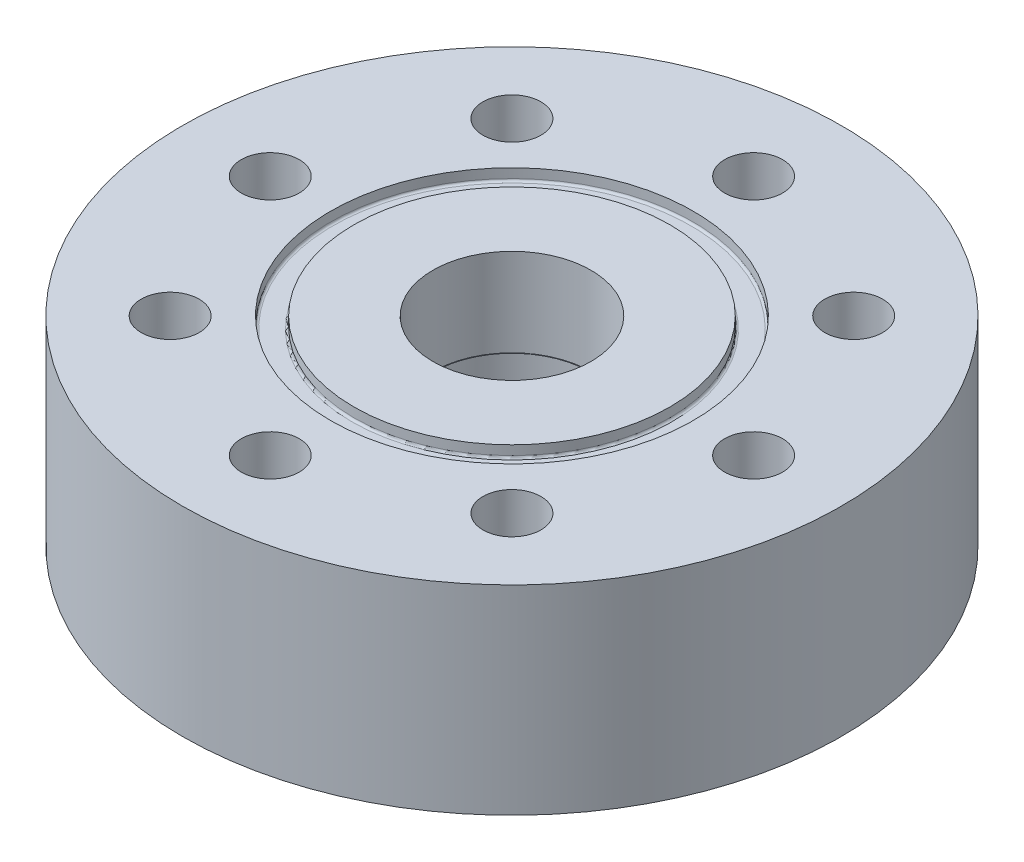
ISO-10303-21;
HEADER;
FILE_DESCRIPTION(('STEP AP214'),'2;1');
FILE_NAME('part.step','',(''),(''),'','','');
FILE_SCHEMA(('AUTOMOTIVE_DESIGN { 1 0 10303 214 1 1 1 1 }'));
ENDSEC;
DATA;
#1=APPLICATION_CONTEXT('core data for automotive mechanical design processes');
#2=APPLICATION_PROTOCOL_DEFINITION('international standard','automotive_design',2000,#1);
#3=PRODUCT_CONTEXT('',#1,'mechanical');
#4=PRODUCT('Part','Part','',(#3));
#5=PRODUCT_RELATED_PRODUCT_CATEGORY('part','',(#4));
#6=PRODUCT_DEFINITION_FORMATION('','',#4);
#7=PRODUCT_DEFINITION_CONTEXT('part definition',#1,'design');
#8=PRODUCT_DEFINITION('design','',#6,#7);
#9=PRODUCT_DEFINITION_SHAPE('','',#8);
#10=(LENGTH_UNIT() NAMED_UNIT(*) SI_UNIT(.MILLI.,.METRE.));
#11=(NAMED_UNIT(*) PLANE_ANGLE_UNIT() SI_UNIT($,.RADIAN.));
#12=(NAMED_UNIT(*) SI_UNIT($,.STERADIAN.) SOLID_ANGLE_UNIT());
#13=UNCERTAINTY_MEASURE_WITH_UNIT(LENGTH_MEASURE(1.E-05),#10,'distance_accuracy_value','');
#14=(GEOMETRIC_REPRESENTATION_CONTEXT(3) GLOBAL_UNCERTAINTY_ASSIGNED_CONTEXT((#13)) GLOBAL_UNIT_ASSIGNED_CONTEXT((#10,
#11,#12)) REPRESENTATION_CONTEXT('',''));
#15=CARTESIAN_POINT('',(0.,0.,0.));
#16=DIRECTION('',(0.,0.,1.));
#17=DIRECTION('',(1.,0.,0.));
#18=AXIS2_PLACEMENT_3D('',#15,#16,#17);
#19=CARTESIAN_POINT('',(0.,22.7,0.));
#20=DIRECTION('',(0.,-1.,0.));
#21=DIRECTION('',(0.,0.,-1.));
#22=AXIS2_PLACEMENT_3D('',#19,#20,#21);
#23=CYLINDRICAL_SURFACE('',#22,37.5);
#24=CARTESIAN_POINT('',(0.,22.7,0.));
#25=DIRECTION('',(0.,1.,0.));
#26=DIRECTION('',(0.,0.,1.));
#27=AXIS2_PLACEMENT_3D('',#24,#25,#26);
#28=CIRCLE('',#27,37.5);
#29=CARTESIAN_POINT('',(0.,22.7,37.5));
#30=VERTEX_POINT('',#29);
#31=EDGE_CURVE('E60',#30,#30,#28,.T.);
#32=ORIENTED_EDGE('',*,*,#31,.F.);
#33=EDGE_LOOP('',(#32));
#34=FACE_BOUND('',#33,.T.);
#35=CARTESIAN_POINT('',(0.,0.,0.));
#36=DIRECTION('',(0.,1.,0.));
#37=DIRECTION('',(0.,0.,1.));
#38=AXIS2_PLACEMENT_3D('',#35,#36,#37);
#39=CIRCLE('',#38,37.5);
#40=CARTESIAN_POINT('',(0.,0.,37.5));
#41=VERTEX_POINT('',#40);
#42=EDGE_CURVE('E61',#41,#41,#39,.T.);
#43=ORIENTED_EDGE('',*,*,#42,.T.);
#44=EDGE_LOOP('',(#43));
#45=FACE_BOUND('',#44,.T.);
#46=ADVANCED_FACE('F36',(#34,#45),#23,.T.);
#47=CARTESIAN_POINT('',(0.,22.7,0.));
#48=DIRECTION('',(0.,1.,0.));
#49=DIRECTION('',(0.,0.,1.));
#50=AXIS2_PLACEMENT_3D('',#47,#48,#49);
#51=PLANE('',#50);
#52=CARTESIAN_POINT('',(0.,22.7,0.));
#53=DIRECTION('',(0.,1.,0.));
#54=DIRECTION('',(0.,0.,1.));
#55=AXIS2_PLACEMENT_3D('',#52,#53,#54);
#56=CIRCLE('',#55,20.6375);
#57=CARTESIAN_POINT('',(0.,22.7,20.6375));
#58=VERTEX_POINT('',#57);
#59=EDGE_CURVE('E84',#58,#58,#56,.T.);
#60=ORIENTED_EDGE('',*,*,#59,.F.);
#61=EDGE_LOOP('',(#60));
#62=FACE_BOUND('',#61,.T.);
#63=CARTESIAN_POINT('',(-27.5,22.7,0.));
#64=DIRECTION('',(0.,-1.,0.));
#65=DIRECTION('',(0.,0.,-1.));
#66=AXIS2_PLACEMENT_3D('',#63,#64,#65);
#67=CIRCLE('',#66,3.3);
#68=CARTESIAN_POINT('',(-27.5,22.7,-3.3));
#69=VERTEX_POINT('',#68);
#70=EDGE_CURVE('E72',#69,#69,#67,.T.);
#71=ORIENTED_EDGE('',*,*,#70,.T.);
#72=EDGE_LOOP('',(#71));
#73=FACE_BOUND('',#72,.T.);
#74=CARTESIAN_POINT('',(-19.44543648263,22.7,19.4454364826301));
#75=DIRECTION('',(0.,-1.,0.));
#76=DIRECTION('',(0.,0.,-1.));
#77=AXIS2_PLACEMENT_3D('',#74,#75,#76);
#78=CIRCLE('',#77,3.30000000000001);
#79=CARTESIAN_POINT('',(-19.44543648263,22.7,16.1454364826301));
#80=VERTEX_POINT('',#79);
#81=EDGE_CURVE('E132',#80,#80,#78,.T.);
#82=ORIENTED_EDGE('',*,*,#81,.T.);
#83=EDGE_LOOP('',(#82));
#84=FACE_BOUND('',#83,.T.);
#85=CARTESIAN_POINT('',(0.,22.7,27.5));
#86=DIRECTION('',(0.,-1.,0.));
#87=DIRECTION('',(0.,0.,-1.));
#88=AXIS2_PLACEMENT_3D('',#85,#86,#87);
#89=CIRCLE('',#88,3.3);
#90=CARTESIAN_POINT('',(0.,22.7,24.2));
#91=VERTEX_POINT('',#90);
#92=EDGE_CURVE('E124',#91,#91,#89,.T.);
#93=ORIENTED_EDGE('',*,*,#92,.T.);
#94=EDGE_LOOP('',(#93));
#95=FACE_BOUND('',#94,.T.);
#96=CARTESIAN_POINT('',(19.4454364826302,22.7,19.44543648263));
#97=DIRECTION('',(0.,-1.,0.));
#98=DIRECTION('',(0.,0.,-1.));
#99=AXIS2_PLACEMENT_3D('',#96,#97,#98);
#100=CIRCLE('',#99,3.3);
#101=CARTESIAN_POINT('',(19.4454364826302,22.7,16.14543648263));
#102=VERTEX_POINT('',#101);
#103=EDGE_CURVE('E116',#102,#102,#100,.T.);
#104=ORIENTED_EDGE('',*,*,#103,.T.);
#105=EDGE_LOOP('',(#104));
#106=FACE_BOUND('',#105,.T.);
#107=CARTESIAN_POINT('',(27.5,22.7,-1.92031473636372E-13));
#108=DIRECTION('',(0.,-1.,0.));
#109=DIRECTION('',(0.,0.,-1.));
#110=AXIS2_PLACEMENT_3D('',#107,#108,#109);
#111=CIRCLE('',#110,3.3);
#112=CARTESIAN_POINT('',(27.5,22.7,-3.30000000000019));
#113=VERTEX_POINT('',#112);
#114=EDGE_CURVE('E108',#113,#113,#111,.T.);
#115=ORIENTED_EDGE('',*,*,#114,.T.);
#116=EDGE_LOOP('',(#115));
#117=FACE_BOUND('',#116,.T.);
#118=CARTESIAN_POINT('',(19.4454364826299,22.7,-19.4454364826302));
#119=DIRECTION('',(0.,-1.,0.));
#120=DIRECTION('',(0.,0.,-1.));
#121=AXIS2_PLACEMENT_3D('',#118,#119,#120);
#122=CIRCLE('',#121,3.3);
#123=CARTESIAN_POINT('',(19.4454364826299,22.7,-22.7454364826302));
#124=VERTEX_POINT('',#123);
#125=EDGE_CURVE('E100',#124,#124,#122,.T.);
#126=ORIENTED_EDGE('',*,*,#125,.T.);
#127=EDGE_LOOP('',(#126));
#128=FACE_BOUND('',#127,.T.);
#129=CARTESIAN_POINT('',(-2.88047210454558E-13,22.7,-27.5));
#130=DIRECTION('',(0.,-1.,0.));
#131=DIRECTION('',(0.,0.,-1.));
#132=AXIS2_PLACEMENT_3D('',#129,#130,#131);
#133=CIRCLE('',#132,3.3);
#134=CARTESIAN_POINT('',(-2.88047210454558E-13,22.7,-30.8));
#135=VERTEX_POINT('',#134);
#136=EDGE_CURVE('E92',#135,#135,#133,.T.);
#137=ORIENTED_EDGE('',*,*,#136,.T.);
#138=EDGE_LOOP('',(#137));
#139=FACE_BOUND('',#138,.T.);
#140=CARTESIAN_POINT('',(-19.4454364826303,22.7,-19.4454364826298));
#141=DIRECTION('',(0.,-1.,0.));
#142=DIRECTION('',(0.,0.,-1.));
#143=AXIS2_PLACEMENT_3D('',#140,#141,#142);
#144=CIRCLE('',#143,3.3);
#145=CARTESIAN_POINT('',(-19.4454364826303,22.7,-22.7454364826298));
#146=VERTEX_POINT('',#145);
#147=EDGE_CURVE('E83',#146,#146,#144,.T.);
#148=ORIENTED_EDGE('',*,*,#147,.T.);
#149=EDGE_LOOP('',(#148));
#150=FACE_BOUND('',#149,.T.);
#151=ORIENTED_EDGE('',*,*,#31,.T.);
#152=EDGE_LOOP('',(#151));
#153=FACE_BOUND('',#152,.T.);
#154=ADVANCED_FACE('F172',(#62,#73,#84,#95,#106,#117,#128,#139,#150,#153),#51,.T.);
#155=CARTESIAN_POINT('',(0.,0.,0.));
#156=DIRECTION('',(0.,1.,0.));
#157=DIRECTION('',(0.,0.,1.));
#158=AXIS2_PLACEMENT_3D('',#155,#156,#157);
#159=PLANE('',#158);
#160=CARTESIAN_POINT('',(-27.5,0.,0.));
#161=DIRECTION('',(0.,-1.,0.));
#162=DIRECTION('',(0.,0.,-1.));
#163=AXIS2_PLACEMENT_3D('',#160,#161,#162);
#164=CIRCLE('',#163,3.3);
#165=CARTESIAN_POINT('',(-27.5,0.,-3.3));
#166=VERTEX_POINT('',#165);
#167=EDGE_CURVE('E136',#166,#166,#164,.T.);
#168=ORIENTED_EDGE('',*,*,#167,.F.);
#169=EDGE_LOOP('',(#168));
#170=FACE_BOUND('',#169,.T.);
#171=CARTESIAN_POINT('',(-19.44543648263,0.,19.4454364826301));
#172=DIRECTION('',(0.,-1.,0.));
#173=DIRECTION('',(0.,0.,-1.));
#174=AXIS2_PLACEMENT_3D('',#171,#172,#173);
#175=CIRCLE('',#174,3.30000000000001);
#176=CARTESIAN_POINT('',(-19.44543648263,0.,16.1454364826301));
#177=VERTEX_POINT('',#176);
#178=EDGE_CURVE('E128',#177,#177,#175,.T.);
#179=ORIENTED_EDGE('',*,*,#178,.F.);
#180=EDGE_LOOP('',(#179));
#181=FACE_BOUND('',#180,.T.);
#182=CARTESIAN_POINT('',(0.,0.,27.5));
#183=DIRECTION('',(0.,-1.,0.));
#184=DIRECTION('',(0.,0.,-1.));
#185=AXIS2_PLACEMENT_3D('',#182,#183,#184);
#186=CIRCLE('',#185,3.3);
#187=CARTESIAN_POINT('',(0.,0.,24.2));
#188=VERTEX_POINT('',#187);
#189=EDGE_CURVE('E120',#188,#188,#186,.T.);
#190=ORIENTED_EDGE('',*,*,#189,.F.);
#191=EDGE_LOOP('',(#190));
#192=FACE_BOUND('',#191,.T.);
#193=CARTESIAN_POINT('',(19.4454364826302,0.,19.44543648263));
#194=DIRECTION('',(0.,-1.,0.));
#195=DIRECTION('',(0.,0.,-1.));
#196=AXIS2_PLACEMENT_3D('',#193,#194,#195);
#197=CIRCLE('',#196,3.3);
#198=CARTESIAN_POINT('',(19.4454364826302,0.,16.14543648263));
#199=VERTEX_POINT('',#198);
#200=EDGE_CURVE('E112',#199,#199,#197,.T.);
#201=ORIENTED_EDGE('',*,*,#200,.F.);
#202=EDGE_LOOP('',(#201));
#203=FACE_BOUND('',#202,.T.);
#204=CARTESIAN_POINT('',(27.5,0.,-1.92031473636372E-13));
#205=DIRECTION('',(0.,-1.,0.));
#206=DIRECTION('',(0.,0.,-1.));
#207=AXIS2_PLACEMENT_3D('',#204,#205,#206);
#208=CIRCLE('',#207,3.3);
#209=CARTESIAN_POINT('',(27.5,0.,-3.30000000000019));
#210=VERTEX_POINT('',#209);
#211=EDGE_CURVE('E104',#210,#210,#208,.T.);
#212=ORIENTED_EDGE('',*,*,#211,.F.);
#213=EDGE_LOOP('',(#212));
#214=FACE_BOUND('',#213,.T.);
#215=CARTESIAN_POINT('',(19.4454364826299,0.,-19.4454364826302));
#216=DIRECTION('',(0.,-1.,0.));
#217=DIRECTION('',(0.,0.,-1.));
#218=AXIS2_PLACEMENT_3D('',#215,#216,#217);
#219=CIRCLE('',#218,3.3);
#220=CARTESIAN_POINT('',(19.4454364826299,0.,-22.7454364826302));
#221=VERTEX_POINT('',#220);
#222=EDGE_CURVE('E96',#221,#221,#219,.T.);
#223=ORIENTED_EDGE('',*,*,#222,.F.);
#224=EDGE_LOOP('',(#223));
#225=FACE_BOUND('',#224,.T.);
#226=CARTESIAN_POINT('',(-2.88047210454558E-13,0.,-27.5));
#227=DIRECTION('',(0.,-1.,0.));
#228=DIRECTION('',(0.,0.,-1.));
#229=AXIS2_PLACEMENT_3D('',#226,#227,#228);
#230=CIRCLE('',#229,3.3);
#231=CARTESIAN_POINT('',(-2.88047210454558E-13,0.,-30.8));
#232=VERTEX_POINT('',#231);
#233=EDGE_CURVE('E88',#232,#232,#230,.T.);
#234=ORIENTED_EDGE('',*,*,#233,.F.);
#235=EDGE_LOOP('',(#234));
#236=FACE_BOUND('',#235,.T.);
#237=CARTESIAN_POINT('',(-19.4454364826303,0.,-19.4454364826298));
#238=DIRECTION('',(0.,-1.,0.));
#239=DIRECTION('',(0.,0.,-1.));
#240=AXIS2_PLACEMENT_3D('',#237,#238,#239);
#241=CIRCLE('',#240,3.3);
#242=CARTESIAN_POINT('',(-19.4454364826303,0.,-22.7454364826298));
#243=VERTEX_POINT('',#242);
#244=EDGE_CURVE('E79',#243,#243,#241,.T.);
#245=ORIENTED_EDGE('',*,*,#244,.F.);
#246=EDGE_LOOP('',(#245));
#247=FACE_BOUND('',#246,.T.);
#248=CARTESIAN_POINT('',(0.,0.,0.));
#249=DIRECTION('',(0.,-1.,0.));
#250=DIRECTION('',(0.,0.,-1.));
#251=AXIS2_PLACEMENT_3D('',#248,#249,#250);
#252=CIRCLE('',#251,8.93);
#253=CARTESIAN_POINT('',(0.,0.,-8.93));
#254=VERTEX_POINT('',#253);
#255=EDGE_CURVE('E65',#254,#254,#252,.T.);
#256=ORIENTED_EDGE('',*,*,#255,.F.);
#257=EDGE_LOOP('',(#256));
#258=FACE_BOUND('',#257,.T.);
#259=ORIENTED_EDGE('',*,*,#42,.F.);
#260=EDGE_LOOP('',(#259));
#261=FACE_BOUND('',#260,.T.);
#262=ADVANCED_FACE('F192',(#170,#181,#192,#203,#214,#225,#236,#247,#258,#261),#159,.F.);
#263=CARTESIAN_POINT('',(0.,12.7,0.));
#264=DIRECTION('',(0.,-1.,0.));
#265=DIRECTION('',(0.,0.,-1.));
#266=AXIS2_PLACEMENT_3D('',#263,#264,#265);
#267=CYLINDRICAL_SURFACE('',#266,8.93);
#268=CARTESIAN_POINT('',(0.,12.7,0.));
#269=DIRECTION('',(0.,-1.,0.));
#270=DIRECTION('',(0.,0.,-1.));
#271=AXIS2_PLACEMENT_3D('',#268,#269,#270);
#272=CIRCLE('',#271,8.93);
#273=CARTESIAN_POINT('',(0.,12.7,-8.93));
#274=VERTEX_POINT('',#273);
#275=EDGE_CURVE('E73',#274,#274,#272,.T.);
#276=ORIENTED_EDGE('',*,*,#275,.F.);
#277=EDGE_LOOP('',(#276));
#278=FACE_BOUND('',#277,.T.);
#279=ORIENTED_EDGE('',*,*,#255,.T.);
#280=EDGE_LOOP('',(#279));
#281=FACE_BOUND('',#280,.T.);
#282=ADVANCED_FACE('F323',(#278,#281),#267,.F.);
#283=CARTESIAN_POINT('',(-19.4454364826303,22.7,-19.4454364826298));
#284=DIRECTION('',(0.,-1.,0.));
#285=DIRECTION('',(0.,0.,-1.));
#286=AXIS2_PLACEMENT_3D('',#283,#284,#285);
#287=CYLINDRICAL_SURFACE('',#286,3.3);
#288=ORIENTED_EDGE('',*,*,#147,.F.);
#289=EDGE_LOOP('',(#288));
#290=FACE_BOUND('',#289,.T.);
#291=ORIENTED_EDGE('',*,*,#244,.T.);
#292=EDGE_LOOP('',(#291));
#293=FACE_BOUND('',#292,.T.);
#294=ADVANCED_FACE('F314',(#290,#293),#287,.F.);
#295=CARTESIAN_POINT('',(-2.88047210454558E-13,22.7,-27.5));
#296=DIRECTION('',(0.,-1.,0.));
#297=DIRECTION('',(0.,0.,-1.));
#298=AXIS2_PLACEMENT_3D('',#295,#296,#297);
#299=CYLINDRICAL_SURFACE('',#298,3.3);
#300=ORIENTED_EDGE('',*,*,#136,.F.);
#301=EDGE_LOOP('',(#300));
#302=FACE_BOUND('',#301,.T.);
#303=ORIENTED_EDGE('',*,*,#233,.T.);
#304=EDGE_LOOP('',(#303));
#305=FACE_BOUND('',#304,.T.);
#306=ADVANCED_FACE('F305',(#302,#305),#299,.F.);
#307=CARTESIAN_POINT('',(19.4454364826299,22.7,-19.4454364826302));
#308=DIRECTION('',(0.,-1.,0.));
#309=DIRECTION('',(0.,0.,-1.));
#310=AXIS2_PLACEMENT_3D('',#307,#308,#309);
#311=CYLINDRICAL_SURFACE('',#310,3.3);
#312=ORIENTED_EDGE('',*,*,#125,.F.);
#313=EDGE_LOOP('',(#312));
#314=FACE_BOUND('',#313,.T.);
#315=ORIENTED_EDGE('',*,*,#222,.T.);
#316=EDGE_LOOP('',(#315));
#317=FACE_BOUND('',#316,.T.);
#318=ADVANCED_FACE('F296',(#314,#317),#311,.F.);
#319=CARTESIAN_POINT('',(27.5,22.7,-1.92031473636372E-13));
#320=DIRECTION('',(0.,-1.,0.));
#321=DIRECTION('',(0.,0.,-1.));
#322=AXIS2_PLACEMENT_3D('',#319,#320,#321);
#323=CYLINDRICAL_SURFACE('',#322,3.3);
#324=ORIENTED_EDGE('',*,*,#114,.F.);
#325=EDGE_LOOP('',(#324));
#326=FACE_BOUND('',#325,.T.);
#327=ORIENTED_EDGE('',*,*,#211,.T.);
#328=EDGE_LOOP('',(#327));
#329=FACE_BOUND('',#328,.T.);
#330=ADVANCED_FACE('F287',(#326,#329),#323,.F.);
#331=CARTESIAN_POINT('',(19.4454364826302,22.7,19.44543648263));
#332=DIRECTION('',(0.,-1.,0.));
#333=DIRECTION('',(0.,0.,-1.));
#334=AXIS2_PLACEMENT_3D('',#331,#332,#333);
#335=CYLINDRICAL_SURFACE('',#334,3.3);
#336=ORIENTED_EDGE('',*,*,#103,.F.);
#337=EDGE_LOOP('',(#336));
#338=FACE_BOUND('',#337,.T.);
#339=ORIENTED_EDGE('',*,*,#200,.T.);
#340=EDGE_LOOP('',(#339));
#341=FACE_BOUND('',#340,.T.);
#342=ADVANCED_FACE('F278',(#338,#341),#335,.F.);
#343=CARTESIAN_POINT('',(0.,22.7,27.5));
#344=DIRECTION('',(0.,-1.,0.));
#345=DIRECTION('',(0.,0.,-1.));
#346=AXIS2_PLACEMENT_3D('',#343,#344,#345);
#347=CYLINDRICAL_SURFACE('',#346,3.3);
#348=ORIENTED_EDGE('',*,*,#92,.F.);
#349=EDGE_LOOP('',(#348));
#350=FACE_BOUND('',#349,.T.);
#351=ORIENTED_EDGE('',*,*,#189,.T.);
#352=EDGE_LOOP('',(#351));
#353=FACE_BOUND('',#352,.T.);
#354=ADVANCED_FACE('F269',(#350,#353),#347,.F.);
#355=CARTESIAN_POINT('',(-19.44543648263,22.7,19.4454364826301));
#356=DIRECTION('',(0.,-1.,0.));
#357=DIRECTION('',(0.,0.,-1.));
#358=AXIS2_PLACEMENT_3D('',#355,#356,#357);
#359=CYLINDRICAL_SURFACE('',#358,3.30000000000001);
#360=ORIENTED_EDGE('',*,*,#81,.F.);
#361=EDGE_LOOP('',(#360));
#362=FACE_BOUND('',#361,.T.);
#363=ORIENTED_EDGE('',*,*,#178,.T.);
#364=EDGE_LOOP('',(#363));
#365=FACE_BOUND('',#364,.T.);
#366=ADVANCED_FACE('F260',(#362,#365),#359,.F.);
#367=CARTESIAN_POINT('',(-27.5,22.7,0.));
#368=DIRECTION('',(0.,-1.,0.));
#369=DIRECTION('',(0.,0.,-1.));
#370=AXIS2_PLACEMENT_3D('',#367,#368,#369);
#371=CYLINDRICAL_SURFACE('',#370,3.3);
#372=ORIENTED_EDGE('',*,*,#70,.F.);
#373=EDGE_LOOP('',(#372));
#374=FACE_BOUND('',#373,.T.);
#375=ORIENTED_EDGE('',*,*,#167,.T.);
#376=EDGE_LOOP('',(#375));
#377=FACE_BOUND('',#376,.T.);
#378=ADVANCED_FACE('F246',(#374,#377),#371,.F.);
#379=CARTESIAN_POINT('',(0.,21.3792,0.));
#380=DIRECTION('',(0.,1.,0.));
#381=DIRECTION('',(0.,0.,1.));
#382=AXIS2_PLACEMENT_3D('',#379,#380,#381);
#383=CYLINDRICAL_SURFACE('',#382,20.6375);
#384=CARTESIAN_POINT('',(0.,21.6332,0.));
#385=DIRECTION('',(0.,1.,0.));
#386=DIRECTION('',(0.,0.,1.));
#387=AXIS2_PLACEMENT_3D('',#384,#385,#386);
#388=CIRCLE('',#387,20.6375);
#389=CARTESIAN_POINT('',(0.,21.6332,20.6375));
#390=VERTEX_POINT('',#389);
#391=EDGE_CURVE('E10',#390,#390,#388,.F.);
#392=ORIENTED_EDGE('',*,*,#391,.T.);
#393=EDGE_LOOP('',(#392));
#394=FACE_BOUND('',#393,.T.);
#395=ORIENTED_EDGE('',*,*,#59,.T.);
#396=EDGE_LOOP('',(#395));
#397=FACE_BOUND('',#396,.T.);
#398=ADVANCED_FACE('F183',(#394,#397),#383,.F.);
#399=CARTESIAN_POINT('',(0.,21.3792,0.));
#400=DIRECTION('',(0.,1.,0.));
#401=DIRECTION('',(0.,0.,1.));
#402=AXIS2_PLACEMENT_3D('',#399,#400,#401);
#403=PLANE('',#402);
#404=CARTESIAN_POINT('',(0.,21.3792,0.));
#405=DIRECTION('',(0.,1.,0.));
#406=DIRECTION('',(0.,0.,1.));
#407=AXIS2_PLACEMENT_3D('',#404,#405,#406);
#408=CIRCLE('',#407,18.2245);
#409=CARTESIAN_POINT('',(0.,21.3792,18.2245));
#410=VERTEX_POINT('',#409);
#411=EDGE_CURVE('E44',#410,#410,#408,.F.);
#412=ORIENTED_EDGE('',*,*,#411,.T.);
#413=EDGE_LOOP('',(#412));
#414=FACE_BOUND('',#413,.T.);
#415=CARTESIAN_POINT('',(0.,21.3792,0.));
#416=DIRECTION('',(0.,1.,0.));
#417=DIRECTION('',(0.,0.,1.));
#418=AXIS2_PLACEMENT_3D('',#415,#416,#417);
#419=CIRCLE('',#418,20.3835);
#420=CARTESIAN_POINT('',(0.,21.3792,20.3835));
#421=VERTEX_POINT('',#420);
#422=EDGE_CURVE('E49',#421,#421,#419,.T.);
#423=ORIENTED_EDGE('',*,*,#422,.T.);
#424=EDGE_LOOP('',(#423));
#425=FACE_BOUND('',#424,.T.);
#426=ADVANCED_FACE('F176',(#414,#425),#403,.T.);
#427=CARTESIAN_POINT('',(0.,21.3792,0.));
#428=DIRECTION('',(0.,1.,0.));
#429=DIRECTION('',(0.,0.,1.));
#430=AXIS2_PLACEMENT_3D('',#427,#428,#429);
#431=CYLINDRICAL_SURFACE('',#430,17.9705);
#432=CARTESIAN_POINT('',(0.,21.6332,0.));
#433=DIRECTION('',(0.,1.,0.));
#434=DIRECTION('',(0.,0.,1.));
#435=AXIS2_PLACEMENT_3D('',#432,#433,#434);
#436=CIRCLE('',#435,17.9705);
#437=CARTESIAN_POINT('',(0.,21.6332,17.9705));
#438=VERTEX_POINT('',#437);
#439=EDGE_CURVE('E54',#438,#438,#436,.T.);
#440=ORIENTED_EDGE('',*,*,#439,.T.);
#441=EDGE_LOOP('',(#440));
#442=FACE_BOUND('',#441,.T.);
#443=CARTESIAN_POINT('',(0.,22.7,0.));
#444=DIRECTION('',(0.,1.,0.));
#445=DIRECTION('',(0.,0.,1.));
#446=AXIS2_PLACEMENT_3D('',#443,#444,#445);
#447=CIRCLE('',#446,17.9705);
#448=CARTESIAN_POINT('',(0.,22.7,17.9705));
#449=VERTEX_POINT('',#448);
#450=EDGE_CURVE('E77',#449,#449,#447,.T.);
#451=ORIENTED_EDGE('',*,*,#450,.F.);
#452=EDGE_LOOP('',(#451));
#453=FACE_BOUND('',#452,.T.);
#454=ADVANCED_FACE('F170',(#442,#453),#431,.T.);
#455=CARTESIAN_POINT('',(0.,22.7,0.));
#456=DIRECTION('',(0.,1.,0.));
#457=DIRECTION('',(0.,0.,1.));
#458=AXIS2_PLACEMENT_3D('',#455,#456,#457);
#459=CIRCLE('',#458,9.);
#460=CARTESIAN_POINT('',(0.,22.7,9.));
#461=VERTEX_POINT('',#460);
#462=EDGE_CURVE('E149',#461,#461,#459,.T.);
#463=ORIENTED_EDGE('',*,*,#462,.F.);
#464=EDGE_LOOP('',(#463));
#465=FACE_BOUND('',#464,.T.);
#466=ORIENTED_EDGE('',*,*,#450,.T.);
#467=EDGE_LOOP('',(#466));
#468=FACE_BOUND('',#467,.T.);
#469=ADVANCED_FACE('F166',(#465,#468),#51,.T.);
#470=CARTESIAN_POINT('',(0.,21.6332,0.));
#471=DIRECTION('',(0.,1.,0.));
#472=DIRECTION('',(0.,0.,1.));
#473=AXIS2_PLACEMENT_3D('',#470,#471,#472);
#474=TOROIDAL_SURFACE('',#473,18.2245,0.254);
#475=ORIENTED_EDGE('',*,*,#411,.F.);
#476=EDGE_LOOP('',(#475));
#477=FACE_BOUND('',#476,.T.);
#478=ORIENTED_EDGE('',*,*,#439,.F.);
#479=EDGE_LOOP('',(#478));
#480=FACE_BOUND('',#479,.T.);
#481=ADVANCED_FACE('F169',(#477,#480),#474,.F.);
#482=CARTESIAN_POINT('',(0.,21.6332,0.));
#483=DIRECTION('',(0.,1.,0.));
#484=DIRECTION('',(0.,0.,1.));
#485=AXIS2_PLACEMENT_3D('',#482,#483,#484);
#486=TOROIDAL_SURFACE('',#485,20.3835,0.254);
#487=ORIENTED_EDGE('',*,*,#391,.F.);
#488=EDGE_LOOP('',(#487));
#489=FACE_BOUND('',#488,.T.);
#490=ORIENTED_EDGE('',*,*,#422,.F.);
#491=EDGE_LOOP('',(#490));
#492=FACE_BOUND('',#491,.T.);
#493=ADVANCED_FACE('F38',(#489,#492),#486,.F.);
#494=CARTESIAN_POINT('',(0.,12.7,0.));
#495=DIRECTION('',(0.,1.,0.));
#496=DIRECTION('',(0.,0.,1.));
#497=AXIS2_PLACEMENT_3D('',#494,#495,#496);
#498=PLANE('',#497);
#499=CARTESIAN_POINT('',(0.,12.7,0.));
#500=DIRECTION('',(0.,1.,0.));
#501=DIRECTION('',(0.,0.,1.));
#502=AXIS2_PLACEMENT_3D('',#499,#500,#501);
#503=CIRCLE('',#502,9.);
#504=CARTESIAN_POINT('',(0.,12.7,9.));
#505=VERTEX_POINT('',#504);
#506=EDGE_CURVE('E78',#505,#505,#503,.T.);
#507=ORIENTED_EDGE('',*,*,#506,.T.);
#508=EDGE_LOOP('',(#507));
#509=FACE_BOUND('',#508,.T.);
#510=ORIENTED_EDGE('',*,*,#275,.T.);
#511=EDGE_LOOP('',(#510));
#512=FACE_BOUND('',#511,.T.);
#513=ADVANCED_FACE('F157',(#509,#512),#498,.T.);
#514=CARTESIAN_POINT('',(0.,12.7,0.));
#515=DIRECTION('',(0.,1.,0.));
#516=DIRECTION('',(0.,0.,1.));
#517=AXIS2_PLACEMENT_3D('',#514,#515,#516);
#518=CYLINDRICAL_SURFACE('',#517,9.);
#519=ORIENTED_EDGE('',*,*,#506,.F.);
#520=EDGE_LOOP('',(#519));
#521=FACE_BOUND('',#520,.T.);
#522=ORIENTED_EDGE('',*,*,#462,.T.);
#523=EDGE_LOOP('',(#522));
#524=FACE_BOUND('',#523,.T.);
#525=ADVANCED_FACE('F160',(#521,#524),#518,.F.);
#526=CLOSED_SHELL('',(#46,#154,#262,#282,#294,#306,#318,#330,#342,#354,#366,#378,#398,#426,#454,
#469,#481,#493,#513,#525));
#527=MANIFOLD_SOLID_BREP('B2',#526);
#528=ADVANCED_BREP_SHAPE_REPRESENTATION('',(#18,#527),#14);
#529=SHAPE_DEFINITION_REPRESENTATION(#9,#528);
ENDSEC;
END-ISO-10303-21;
